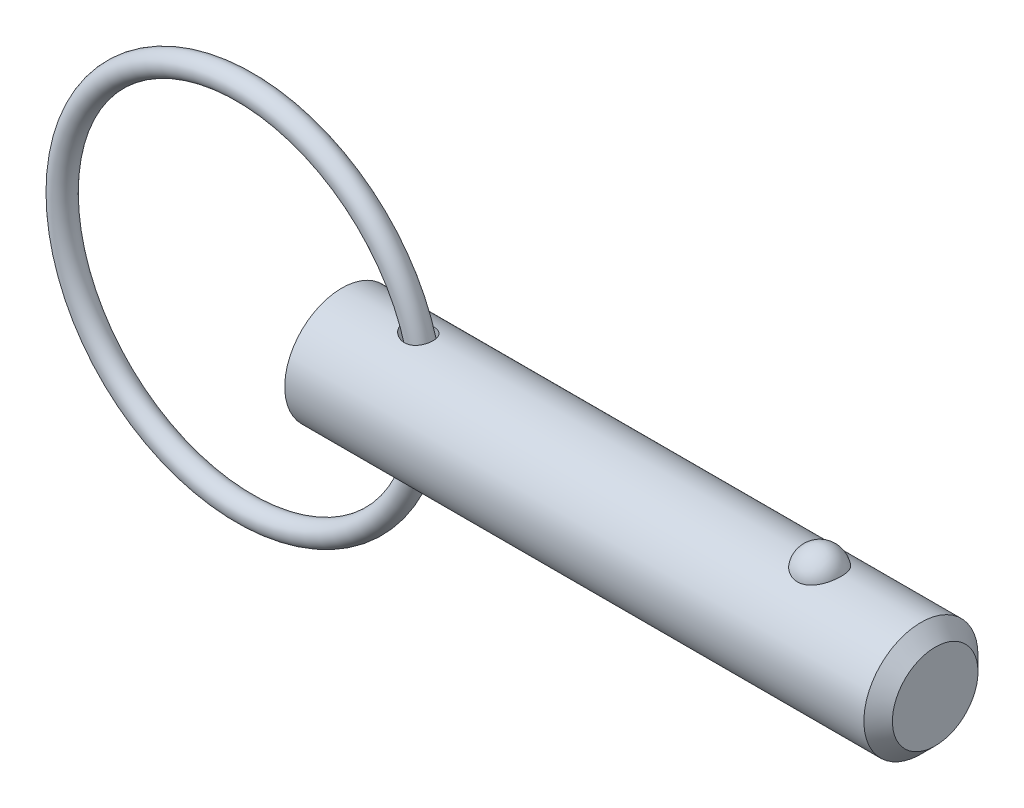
ISO-10303-21;
HEADER;
FILE_DESCRIPTION(('STEP AP214'),'2;1');
FILE_NAME('part.step','',(''),(''),'','','');
FILE_SCHEMA(('AUTOMOTIVE_DESIGN { 1 0 10303 214 1 1 1 1 }'));
ENDSEC;
DATA;
#1=APPLICATION_CONTEXT('core data for automotive mechanical design processes');
#2=APPLICATION_PROTOCOL_DEFINITION('international standard','automotive_design',2000,#1);
#3=PRODUCT_CONTEXT('',#1,'mechanical');
#4=PRODUCT('Part','Part','',(#3));
#5=PRODUCT_RELATED_PRODUCT_CATEGORY('part','',(#4));
#6=PRODUCT_DEFINITION_FORMATION('','',#4);
#7=PRODUCT_DEFINITION_CONTEXT('part definition',#1,'design');
#8=PRODUCT_DEFINITION('design','',#6,#7);
#9=PRODUCT_DEFINITION_SHAPE('','',#8);
#10=(LENGTH_UNIT() NAMED_UNIT(*) SI_UNIT(.MILLI.,.METRE.));
#11=(NAMED_UNIT(*) PLANE_ANGLE_UNIT() SI_UNIT($,.RADIAN.));
#12=(NAMED_UNIT(*) SI_UNIT($,.STERADIAN.) SOLID_ANGLE_UNIT());
#13=UNCERTAINTY_MEASURE_WITH_UNIT(LENGTH_MEASURE(1.E-05),#10,'distance_accuracy_value','');
#14=(GEOMETRIC_REPRESENTATION_CONTEXT(3) GLOBAL_UNCERTAINTY_ASSIGNED_CONTEXT((#13)) GLOBAL_UNIT_ASSIGNED_CONTEXT((#10,
#11,#12)) REPRESENTATION_CONTEXT('',''));
#15=CARTESIAN_POINT('',(0.,0.,0.));
#16=DIRECTION('',(0.,0.,1.));
#17=DIRECTION('',(1.,0.,0.));
#18=AXIS2_PLACEMENT_3D('',#15,#16,#17);
#19=CARTESIAN_POINT('',(-6.75433730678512,0.,0.));
#20=DIRECTION('',(0.,0.,1.));
#21=DIRECTION('',(1.,0.,0.));
#22=AXIS2_PLACEMENT_3D('',#19,#20,#21);
#23=TOROIDAL_SURFACE('',#22,12.7,0.794);
#24=CARTESIAN_POINT('',(6.73966269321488,0.,0.));
#25=VERTEX_POINT('',#24);
#26=VERTEX_LOOP('',#25);
#27=FACE_BOUND('',#26,.T.);
#28=ADVANCED_FACE('P0_F12',(#27),#23,.T.);
#29=CLOSED_SHELL('',(#28));
#30=MANIFOLD_SOLID_BREP('P0_B1',#29);
#31=CARTESIAN_POINT('',(0.,0.,0.));
#32=DIRECTION('',(1.,0.,0.));
#33=DIRECTION('',(0.,0.,-1.));
#34=AXIS2_PLACEMENT_3D('',#31,#32,#33);
#35=CYLINDRICAL_SURFACE('',#34,3.97);
#36=CARTESIAN_POINT('',(4.5061340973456,3.92152479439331,-0.618499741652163));
#37=CARTESIAN_POINT('',(4.54853517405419,3.91408351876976,-0.66567962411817));
#38=CARTESIAN_POINT('',(4.59520918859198,3.90637054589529,-0.709047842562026));
#39=CARTESIAN_POINT('',(4.69529850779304,3.89134328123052,-0.787367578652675));
#40=CARTESIAN_POINT('',(4.74872860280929,3.88402991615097,-0.822300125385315));
#41=CARTESIAN_POINT('',(4.86059505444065,3.87069188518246,-0.882953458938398));
#42=CARTESIAN_POINT('',(4.91902090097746,3.86466460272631,-0.908693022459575));
#43=CARTESIAN_POINT('',(5.03942053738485,3.85463812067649,-0.950329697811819));
#44=CARTESIAN_POINT('',(5.10139227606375,3.85063776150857,-0.966232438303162));
#45=CARTESIAN_POINT('',(5.22799334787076,3.84521819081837,-0.987584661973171));
#46=CARTESIAN_POINT('',(5.29264515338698,3.84382942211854,-0.992910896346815));
#47=CARTESIAN_POINT('',(5.42187784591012,3.84405510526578,-0.992040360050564));
#48=CARTESIAN_POINT('',(5.48645875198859,3.84566813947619,-0.985849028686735));
#49=CARTESIAN_POINT('',(5.60832575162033,3.85155853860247,-0.962561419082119));
#50=CARTESIAN_POINT('',(5.66579014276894,3.85562063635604,-0.946343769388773));
#51=CARTESIAN_POINT('',(5.7767533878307,3.86576598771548,-0.90400447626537));
#52=CARTESIAN_POINT('',(5.8302537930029,3.87184844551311,-0.877886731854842));
#53=CARTESIAN_POINT('',(5.92811265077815,3.88482601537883,-0.818464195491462));
#54=CARTESIAN_POINT('',(5.97284196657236,3.89164057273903,-0.785750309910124));
#55=CARTESIAN_POINT('',(6.05599619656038,3.90559314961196,-0.713164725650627));
#56=CARTESIAN_POINT('',(6.09442162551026,3.91273114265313,-0.673293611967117));
#57=CARTESIAN_POINT('',(6.16349552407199,3.92643411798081,-0.588089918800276));
#58=CARTESIAN_POINT('',(6.19423746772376,3.93300527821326,-0.542833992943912));
#59=CARTESIAN_POINT('',(6.24784048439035,3.94496273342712,-0.447731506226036));
#60=CARTESIAN_POINT('',(6.27070130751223,3.95034899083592,-0.397884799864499));
#61=CARTESIAN_POINT('',(6.30819009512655,3.95940331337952,-0.294515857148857));
#62=CARTESIAN_POINT('',(6.32274046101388,3.96305513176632,-0.240964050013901));
#63=CARTESIAN_POINT('',(6.34295490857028,3.96817541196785,-0.13210707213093));
#64=CARTESIAN_POINT('',(6.34861870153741,3.96964380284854,-0.0768018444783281));
#65=CARTESIAN_POINT('',(6.35094049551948,3.97024250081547,0.0343098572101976));
#66=CARTESIAN_POINT('',(6.34754972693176,3.96936014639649,0.090117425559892));
#67=CARTESIAN_POINT('',(6.33173352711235,3.9653248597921,0.200354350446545));
#68=CARTESIAN_POINT('',(6.31930791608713,3.96217188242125,0.25478367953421));
#69=CARTESIAN_POINT('',(6.28569545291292,3.95393415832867,0.360736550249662));
#70=CARTESIAN_POINT('',(6.26450524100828,3.94884867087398,0.41225896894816));
#71=CARTESIAN_POINT('',(6.21385621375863,3.93730247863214,0.510898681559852));
#72=CARTESIAN_POINT('',(6.1843975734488,3.93084180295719,0.558016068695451));
#73=CARTESIAN_POINT('',(6.11807283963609,3.91729312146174,0.64630042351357));
#74=CARTESIAN_POINT('',(6.08123803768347,3.91020783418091,0.68749130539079));
#75=CARTESIAN_POINT('',(6.00105036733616,3.89618447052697,0.762970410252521));
#76=CARTESIAN_POINT('',(5.95769831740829,3.88924637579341,0.797259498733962));
#77=CARTESIAN_POINT('',(5.86613530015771,3.87636375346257,0.857702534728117));
#78=CARTESIAN_POINT('',(5.81797537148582,3.87041026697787,0.883931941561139));
#79=CARTESIAN_POINT('',(5.71784316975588,3.86006042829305,0.928089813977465));
#80=CARTESIAN_POINT('',(5.66587104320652,3.85566401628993,0.946018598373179));
#81=CARTESIAN_POINT('',(5.55935910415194,3.84884784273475,0.973381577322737));
#82=CARTESIAN_POINT('',(5.5048082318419,3.84643760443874,0.982774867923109));
#83=CARTESIAN_POINT('',(5.39486598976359,3.84381055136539,0.992999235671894));
#84=CARTESIAN_POINT('',(5.33947443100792,3.84359423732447,0.993828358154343));
#85=CARTESIAN_POINT('',(5.2264823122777,3.84533176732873,0.987084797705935));
#86=CARTESIAN_POINT('',(5.16890896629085,3.84739412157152,0.979092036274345));
#87=CARTESIAN_POINT('',(5.05572652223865,3.85355237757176,0.954563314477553));
#88=CARTESIAN_POINT('',(5.0001182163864,3.85764908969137,0.938023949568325));
#89=CARTESIAN_POINT('',(4.88760177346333,3.86780726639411,0.8952592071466));
#90=CARTESIAN_POINT('',(4.83096658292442,3.87400321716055,0.868345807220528));
#91=CARTESIAN_POINT('',(4.72283286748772,3.88749324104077,0.805802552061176));
#92=CARTESIAN_POINT('',(4.67133743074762,3.89478796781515,0.770167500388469));
#93=CARTESIAN_POINT('',(4.57320957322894,3.90992457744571,0.689306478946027));
#94=CARTESIAN_POINT('',(4.52683185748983,3.91777672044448,0.643771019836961));
#95=CARTESIAN_POINT('',(4.44324307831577,3.93275681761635,0.544809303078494));
#96=CARTESIAN_POINT('',(4.40602610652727,3.939885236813,0.491388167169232));
#97=CARTESIAN_POINT('',(4.34571986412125,3.95183347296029,0.382912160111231));
#98=CARTESIAN_POINT('',(4.32168268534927,3.95680025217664,0.32840447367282));
#99=CARTESIAN_POINT('',(4.28478280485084,3.96454157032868,0.215602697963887));
#100=CARTESIAN_POINT('',(4.27190231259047,3.96731959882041,0.157314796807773));
#101=CARTESIAN_POINT('',(4.25937356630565,3.97002560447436,0.0481762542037));
#102=CARTESIAN_POINT('',(4.25802727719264,3.97031923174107,-0.0024752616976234));
#103=CARTESIAN_POINT('',(4.26422295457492,3.96897737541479,-0.103210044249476));
#104=CARTESIAN_POINT('',(4.27176468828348,3.96734194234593,-0.15329332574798));
#105=CARTESIAN_POINT('',(4.29457390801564,3.96248430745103,-0.24853074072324));
#106=CARTESIAN_POINT('',(4.30937736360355,3.95935769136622,-0.293803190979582));
#107=CARTESIAN_POINT('',(4.34569993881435,3.95187968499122,-0.381417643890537));
#108=CARTESIAN_POINT('',(4.36721517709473,3.94752900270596,-0.423761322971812));
#109=CARTESIAN_POINT('',(4.4082169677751,3.93952317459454,-0.491758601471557));
#110=CARTESIAN_POINT('',(4.4261351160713,3.93609353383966,-0.518404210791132));
#111=CARTESIAN_POINT('',(4.464383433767,3.92897396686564,-0.569857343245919));
#112=CARTESIAN_POINT('',(4.48471350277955,3.92528405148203,-0.594664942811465));
#113=CARTESIAN_POINT('',(4.5061340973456,3.92152479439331,-0.618499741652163));
#114=B_SPLINE_CURVE_WITH_KNOTS('',3,(#36,#37,#38,#39,#40,#41,#42,#43,#44,#45,#46,#47,#48,#49,
#50,#51,#52,#53,#54,#55,#56,#57,#58,#59,#60,#61,#62,#63,#64,#65,#66,#67,#68,#69,#70,#71,#72,#73,
#74,#75,#76,#77,#78,#79,#80,#81,#82,#83,#84,#85,#86,#87,#88,#89,#90,#91,#92,#93,#94,#95,#96,#97,
#98,#99,#100,#101,#102,#103,#104,#105,#106,#107,#108,#109,#110,#111,#112,#113),.UNSPECIFIED.,
.T.,.F.,(4,2,2,2,2,2,2,2,2,2,2,2,2,2,2,2,2,2,2,2,2,2,2,2,2,2,2,2,2,2,2,2,2,2,2,2,2,2,4),(0.,
0.191481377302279,0.383389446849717,0.574903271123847,0.766307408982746,0.959929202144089,
1.15345957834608,1.33205157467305,1.51057330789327,1.67726576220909,1.84394459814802,
2.00848443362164,2.17302948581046,2.33908685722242,2.50514962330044,2.6721086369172,
2.83907097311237,3.00609737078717,3.17312023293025,3.33944900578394,3.5057569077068,
3.67045663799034,3.83515004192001,4.00062859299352,4.16614491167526,4.33989638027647,
4.51371711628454,4.70191549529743,4.8902262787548,5.0855971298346,5.28084164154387,
5.45908728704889,5.63704817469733,5.78825771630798,5.93946329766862,6.08206496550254,
6.22458432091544,6.32132279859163,6.41805725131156),.UNSPECIFIED.);
#115=CARTESIAN_POINT('',(4.5061340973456,3.92152479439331,-0.618499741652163));
#116=VERTEX_POINT('',#115);
#117=EDGE_CURVE('P1_E40',#116,#116,#114,.T.);
#118=ORIENTED_EDGE('',*,*,#117,.T.);
#119=EDGE_LOOP('',(#118));
#120=FACE_BOUND('',#119,.T.);
#121=CARTESIAN_POINT('',(40.2875,0.,0.));
#122=DIRECTION('',(1.,0.,0.));
#123=DIRECTION('',(0.,0.,-1.));
#124=AXIS2_PLACEMENT_3D('',#121,#122,#123);
#125=CIRCLE('',#124,3.97);
#126=CARTESIAN_POINT('',(40.2875,0.,-3.97));
#127=VERTEX_POINT('',#126);
#128=EDGE_CURVE('P1_E25',#127,#127,#125,.T.);
#129=ORIENTED_EDGE('',*,*,#128,.F.);
#130=EDGE_LOOP('',(#129));
#131=FACE_BOUND('',#130,.T.);
#132=CARTESIAN_POINT('',(0.,0.,0.));
#133=DIRECTION('',(1.,0.,0.));
#134=DIRECTION('',(0.,0.,-1.));
#135=AXIS2_PLACEMENT_3D('',#132,#133,#134);
#136=CIRCLE('',#135,3.97);
#137=CARTESIAN_POINT('',(0.,0.,-3.97));
#138=VERTEX_POINT('',#137);
#139=EDGE_CURVE('P1_E9',#138,#138,#136,.T.);
#140=ORIENTED_EDGE('',*,*,#139,.T.);
#141=EDGE_LOOP('',(#140));
#142=FACE_BOUND('',#141,.T.);
#143=CARTESIAN_POINT('',(33.2451922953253,3.65715365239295,1.54470941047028));
#144=CARTESIAN_POINT('',(33.1652448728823,3.65716001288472,1.54470290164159));
#145=CARTESIAN_POINT('',(33.0851650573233,3.65987074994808,1.53832549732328));
#146=CARTESIAN_POINT('',(32.9272374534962,3.6704221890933,1.51297018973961));
#147=CARTESIAN_POINT('',(32.8493961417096,3.67827646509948,1.49395894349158));
#148=CARTESIAN_POINT('',(32.6984614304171,3.69818848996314,1.44395950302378));
#149=CARTESIAN_POINT('',(32.6253560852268,3.71023513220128,1.41300293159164));
#150=CARTESIAN_POINT('',(32.4855630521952,3.73721833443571,1.34000212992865));
#151=CARTESIAN_POINT('',(32.4188725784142,3.75215363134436,1.2979627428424));
#152=CARTESIAN_POINT('',(32.29148864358,3.78384968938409,1.20248834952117));
#153=CARTESIAN_POINT('',(32.2310299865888,3.80065129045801,1.14875388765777));
#154=CARTESIAN_POINT('',(32.1196942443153,3.83398532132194,1.03205417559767));
#155=CARTESIAN_POINT('',(32.0688200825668,3.85051766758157,0.969086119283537));
#156=CARTESIAN_POINT('',(31.9756321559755,3.88238608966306,0.832526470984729));
#157=CARTESIAN_POINT('',(31.9337961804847,3.89763698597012,0.758588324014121));
#158=CARTESIAN_POINT('',(31.8625108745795,3.92451063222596,0.60435211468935));
#159=CARTESIAN_POINT('',(31.8330623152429,3.93613315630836,0.524053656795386));
#160=CARTESIAN_POINT('',(31.7868927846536,3.95467606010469,0.35840348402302));
#161=CARTESIAN_POINT('',(31.7703127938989,3.96154426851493,0.273006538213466));
#162=CARTESIAN_POINT('',(31.750756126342,3.96967008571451,0.100408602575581));
#163=CARTESIAN_POINT('',(31.7477789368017,3.97092790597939,0.0132076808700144));
#164=CARTESIAN_POINT('',(31.7554587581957,3.96771794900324,-0.159844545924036));
#165=CARTESIAN_POINT('',(31.7660164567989,3.96329187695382,-0.245701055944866));
#166=CARTESIAN_POINT('',(31.8003800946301,3.94923163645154,-0.414277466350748));
#167=CARTESIAN_POINT('',(31.8241862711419,3.9395973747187,-0.496997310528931));
#168=CARTESIAN_POINT('',(31.8846114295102,3.91607752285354,-0.657113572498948));
#169=CARTESIAN_POINT('',(31.9212495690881,3.90218558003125,-0.734501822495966));
#170=CARTESIAN_POINT('',(32.0065935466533,3.87158287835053,-0.881704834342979));
#171=CARTESIAN_POINT('',(32.0553004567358,3.8548718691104,-0.951518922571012));
#172=CARTESIAN_POINT('',(32.1641161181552,3.82028735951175,-1.08208159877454));
#173=CARTESIAN_POINT('',(32.2242955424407,3.80240713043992,-1.14276958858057));
#174=CARTESIAN_POINT('',(32.354493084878,3.76758161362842,-1.2528243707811));
#175=CARTESIAN_POINT('',(32.4245105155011,3.75063626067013,-1.30219195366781));
#176=CARTESIAN_POINT('',(32.57118160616,3.71998948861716,-1.38729709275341));
#177=CARTESIAN_POINT('',(32.6476813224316,3.70623183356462,-1.42327904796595));
#178=CARTESIAN_POINT('',(32.8062981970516,3.68323188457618,-1.48178996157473));
#179=CARTESIAN_POINT('',(32.8884132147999,3.67398788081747,-1.5043240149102));
#180=CARTESIAN_POINT('',(33.0514810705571,3.6615216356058,-1.53440939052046));
#181=CARTESIAN_POINT('',(33.1322840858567,3.65801951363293,-1.54265826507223));
#182=CARTESIAN_POINT('',(33.2942085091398,3.65657341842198,-1.5460842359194));
#183=CARTESIAN_POINT('',(33.3753298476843,3.65862829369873,-1.54126404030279));
#184=CARTESIAN_POINT('',(33.5328122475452,3.66788969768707,-1.51908474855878));
#185=CARTESIAN_POINT('',(33.6092422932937,3.67492621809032,-1.50213925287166));
#186=CARTESIAN_POINT('',(33.7580412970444,3.69318404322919,-1.45666982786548));
#187=CARTESIAN_POINT('',(33.8304099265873,3.70440568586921,-1.42814496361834));
#188=CARTESIAN_POINT('',(33.9708029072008,3.73012749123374,-1.35956319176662));
#189=CARTESIAN_POINT('',(34.0387000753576,3.74469307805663,-1.31927107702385));
#190=CARTESIAN_POINT('',(34.1668649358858,3.77545272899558,-1.22847440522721));
#191=CARTESIAN_POINT('',(34.2271308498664,3.79164717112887,-1.17796747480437));
#192=CARTESIAN_POINT('',(34.3416346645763,3.82490325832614,-1.06519260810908));
#193=CARTESIAN_POINT('',(34.3954137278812,3.84196735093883,-1.00245914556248));
#194=CARTESIAN_POINT('',(34.4920988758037,3.87439863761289,-0.868715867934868));
#195=CARTESIAN_POINT('',(34.5350030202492,3.88976552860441,-0.797704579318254));
#196=CARTESIAN_POINT('',(34.610266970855,3.91771381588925,-0.646896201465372));
#197=CARTESIAN_POINT('',(34.6422532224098,3.93019255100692,-0.566893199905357));
#198=CARTESIAN_POINT('',(34.6931101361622,3.95043886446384,-0.40225513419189));
#199=CARTESIAN_POINT('',(34.7119807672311,3.95820643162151,-0.317620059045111));
#200=CARTESIAN_POINT('',(34.7362162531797,3.96823733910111,-0.14615699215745));
#201=CARTESIAN_POINT('',(34.7415874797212,3.970503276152,-0.0593300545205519));
#202=CARTESIAN_POINT('',(34.738730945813,3.96930811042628,0.114057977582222));
#203=CARTESIAN_POINT('',(34.7305035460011,3.9658471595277,0.200619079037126));
#204=CARTESIAN_POINT('',(34.7007063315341,3.95358562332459,0.370506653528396));
#205=CARTESIAN_POINT('',(34.6792129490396,3.94481563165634,0.453848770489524));
#206=CARTESIAN_POINT('',(34.6233839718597,3.92284586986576,0.615497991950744));
#207=CARTESIAN_POINT('',(34.5890474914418,3.90964579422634,0.693804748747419));
#208=CARTESIAN_POINT('',(34.5079702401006,3.88006987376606,0.843703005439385));
#209=CARTESIAN_POINT('',(34.4611536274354,3.86367478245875,0.915249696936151));
#210=CARTESIAN_POINT('',(34.3561897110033,3.82949741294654,1.04910810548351));
#211=CARTESIAN_POINT('',(34.2980428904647,3.81171519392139,1.11142021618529));
#212=CARTESIAN_POINT('',(34.1717433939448,3.77673366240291,1.22503948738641));
#213=CARTESIAN_POINT('',(34.1035970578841,3.75953398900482,1.27635357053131));
#214=CARTESIAN_POINT('',(33.9589009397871,3.72770506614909,1.36653336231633));
#215=CARTESIAN_POINT('',(33.882348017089,3.71307678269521,1.40539439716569));
#216=CARTESIAN_POINT('',(33.7257594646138,3.68864287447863,1.46830480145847));
#217=CARTESIAN_POINT('',(33.6459307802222,3.67869017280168,1.49281289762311));
#218=CARTESIAN_POINT('',(33.4829877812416,3.66414535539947,1.52817474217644));
#219=CARTESIAN_POINT('',(33.3998840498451,3.65953723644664,1.53906926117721));
#220=CARTESIAN_POINT('',(33.2927760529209,3.6573894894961,1.54414878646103));
#221=CARTESIAN_POINT('',(33.2689900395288,3.65715175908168,1.54471134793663));
#222=CARTESIAN_POINT('',(33.2451922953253,3.65715365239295,1.54470941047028));
#223=B_SPLINE_CURVE_WITH_KNOTS('',3,(#143,#144,#145,#146,#147,#148,#149,#150,#151,#152,#153,
#154,#155,#156,#157,#158,#159,#160,#161,#162,#163,#164,#165,#166,#167,#168,#169,#170,#171,#172,
#173,#174,#175,#176,#177,#178,#179,#180,#181,#182,#183,#184,#185,#186,#187,#188,#189,#190,#191,
#192,#193,#194,#195,#196,#197,#198,#199,#200,#201,#202,#203,#204,#205,#206,#207,#208,#209,#210,
#211,#212,#213,#214,#215,#216,#217,#218,#219,#220,#221,#222),.UNSPECIFIED.,.T.,.F.,(4,2,2,2,2,2,
2,2,2,2,2,2,2,2,2,2,2,2,2,2,2,2,2,2,2,2,2,2,2,2,2,2,2,2,2,2,2,2,2,4),(0.,0.239777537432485,
0.480190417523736,0.719971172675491,0.959647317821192,1.20639040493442,1.4532086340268,
1.7109367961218,1.96868099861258,2.22921052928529,2.48973023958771,2.74834928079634,
3.00697295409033,3.26598440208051,3.52501886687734,3.78570385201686,4.04637062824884,
4.30201257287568,4.55755760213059,4.80022994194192,5.04285200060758,5.27757006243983,
5.51230707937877,5.75210128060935,5.99195126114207,6.24392810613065,6.49594987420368,
6.75588818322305,7.01582710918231,7.27564332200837,7.53545264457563,7.79377886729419,
8.0521229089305,8.31207418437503,8.57201437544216,8.83179046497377,9.09166393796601,
9.34270057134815,9.59298357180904,9.66435753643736),.UNSPECIFIED.);
#224=CARTESIAN_POINT('',(33.2451922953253,3.65715365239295,1.54470941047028));
#225=VERTEX_POINT('',#224);
#226=EDGE_CURVE('P1_E34',#225,#225,#223,.T.);
#227=ORIENTED_EDGE('',*,*,#226,.T.);
#228=EDGE_LOOP('',(#227));
#229=FACE_BOUND('',#228,.T.);
#230=CARTESIAN_POINT('',(4.5061340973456,-3.92152479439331,-0.618499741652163));
#231=CARTESIAN_POINT('',(4.47063221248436,-3.92775524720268,-0.578995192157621));
#232=CARTESIAN_POINT('',(4.43810149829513,-3.93379908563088,-0.536794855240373));
#233=CARTESIAN_POINT('',(4.38017497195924,-3.94493883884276,-0.447628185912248));
#234=CARTESIAN_POINT('',(4.35477467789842,-3.95003534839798,-0.400664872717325));
#235=CARTESIAN_POINT('',(4.31221789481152,-3.95875465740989,-0.302642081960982));
#236=CARTESIAN_POINT('',(4.29511088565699,-3.96236859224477,-0.251560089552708));
#237=CARTESIAN_POINT('',(4.27046538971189,-3.96762012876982,-0.147036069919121));
#238=CARTESIAN_POINT('',(4.26292104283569,-3.96925894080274,-0.0935955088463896));
#239=CARTESIAN_POINT('',(4.25814817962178,-3.97029345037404,0.00916757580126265));
#240=CARTESIAN_POINT('',(4.26009234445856,-3.96986905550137,0.058451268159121));
#241=CARTESIAN_POINT('',(4.2722946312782,-3.96723648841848,0.155921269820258));
#242=CARTESIAN_POINT('',(4.28255257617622,-3.96502835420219,0.204107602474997));
#243=CARTESIAN_POINT('',(4.3104038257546,-3.95915538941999,0.296804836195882));
#244=CARTESIAN_POINT('',(4.32779766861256,-3.95553028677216,0.341378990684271));
#245=CARTESIAN_POINT('',(4.36906896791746,-3.94717481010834,0.427290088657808));
#246=CARTESIAN_POINT('',(4.3929482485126,-3.94244412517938,0.468626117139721));
#247=CARTESIAN_POINT('',(4.44891306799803,-3.93178155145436,0.551268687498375));
#248=CARTESIAN_POINT('',(4.48157347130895,-3.92577737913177,0.592175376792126));
#249=CARTESIAN_POINT('',(4.55251112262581,-3.91346489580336,0.668729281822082));
#250=CARTESIAN_POINT('',(4.59079150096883,-3.90715641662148,0.704373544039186));
#251=CARTESIAN_POINT('',(4.67775521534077,-3.89387548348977,0.774654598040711));
#252=CARTESIAN_POINT('',(4.72714377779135,-3.88693620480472,0.808427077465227));
#253=CARTESIAN_POINT('',(4.83064277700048,-3.8740635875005,0.868022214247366));
#254=CARTESIAN_POINT('',(4.88475591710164,-3.86813083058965,0.893840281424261));
#255=CARTESIAN_POINT('',(5.00110106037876,-3.85749476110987,0.938729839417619));
#256=CARTESIAN_POINT('',(5.06363405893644,-3.85293457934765,0.957062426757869));
#257=CARTESIAN_POINT('',(5.19104406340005,-3.84642688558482,0.98289453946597));
#258=CARTESIAN_POINT('',(5.25592057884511,-3.84447883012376,0.990396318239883));
#259=CARTESIAN_POINT('',(5.38389367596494,-3.84360582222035,0.993779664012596));
#260=CARTESIAN_POINT('',(5.44697893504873,-3.84458391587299,0.990033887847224));
#261=CARTESIAN_POINT('',(5.57135239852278,-3.84935403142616,0.971322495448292));
#262=CARTESIAN_POINT('',(5.63264168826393,-3.85314431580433,0.956363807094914));
#263=CARTESIAN_POINT('',(5.74616757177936,-3.86267246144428,0.917075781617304));
#264=CARTESIAN_POINT('',(5.79873169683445,-3.86821908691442,0.893643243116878));
#265=CARTESIAN_POINT('',(5.89880370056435,-3.88065529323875,0.837987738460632));
#266=CARTESIAN_POINT('',(5.94631268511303,-3.88754457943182,0.805766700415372));
#267=CARTESIAN_POINT('',(6.03285109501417,-3.90151699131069,0.735052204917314));
#268=CARTESIAN_POINT('',(6.07216200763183,-3.90857818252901,0.696897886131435));
#269=CARTESIAN_POINT('',(6.14379115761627,-3.92238187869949,0.614461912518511));
#270=CARTESIAN_POINT('',(6.17610956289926,-3.92912439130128,0.570180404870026));
#271=CARTESIAN_POINT('',(6.23298117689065,-3.94155789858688,0.476700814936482));
#272=CARTESIAN_POINT('',(6.25752764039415,-3.94724797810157,0.427498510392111));
#273=CARTESIAN_POINT('',(6.29825018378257,-3.95695712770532,0.325589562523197));
#274=CARTESIAN_POINT('',(6.31442591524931,-3.96097612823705,0.272882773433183));
#275=CARTESIAN_POINT('',(6.33815165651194,-3.96694319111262,0.164947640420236));
#276=CARTESIAN_POINT('',(6.34562253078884,-3.96887224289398,0.10970083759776));
#277=CARTESIAN_POINT('',(6.35150690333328,-3.97038782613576,-0.00130546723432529));
#278=CARTESIAN_POINT('',(6.34992017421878,-3.96997429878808,-0.057064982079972));
#279=CARTESIAN_POINT('',(6.33770614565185,-3.96684417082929,-0.16768512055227));
#280=CARTESIAN_POINT('',(6.32705245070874,-3.96412084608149,-0.222542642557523));
#281=CARTESIAN_POINT('',(6.29690849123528,-3.95665587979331,-0.329631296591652));
#282=CARTESIAN_POINT('',(6.27741810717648,-3.95191421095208,-0.381862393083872));
#283=CARTESIAN_POINT('',(6.23007557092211,-3.94093577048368,-0.482151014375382));
#284=CARTESIAN_POINT('',(6.20223216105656,-3.93470056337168,-0.530212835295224));
#285=CARTESIAN_POINT('',(6.13885089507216,-3.92142345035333,-0.620836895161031));
#286=CARTESIAN_POINT('',(6.10331353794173,-3.9143815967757,-0.663399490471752));
#287=CARTESIAN_POINT('',(6.02573506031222,-3.90033441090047,-0.741525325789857));
#288=CARTESIAN_POINT('',(5.9837408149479,-3.89332916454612,-0.777135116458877));
#289=CARTESIAN_POINT('',(5.89422937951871,-3.88009391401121,-0.840731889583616));
#290=CARTESIAN_POINT('',(5.84671289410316,-3.87386381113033,-0.868719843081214));
#291=CARTESIAN_POINT('',(5.74792005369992,-3.86290904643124,-0.916201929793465));
#292=CARTESIAN_POINT('',(5.69667597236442,-3.85817300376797,-0.935760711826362));
#293=CARTESIAN_POINT('',(5.59158164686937,-3.85061943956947,-0.966374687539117));
#294=CARTESIAN_POINT('',(5.53773121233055,-3.84780205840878,-0.97742925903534));
#295=CARTESIAN_POINT('',(5.42780663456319,-3.84428235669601,-0.991183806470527));
#296=CARTESIAN_POINT('',(5.37170954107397,-3.84362414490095,-0.993709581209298));
#297=CARTESIAN_POINT('',(5.25980914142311,-3.84452352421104,-0.990222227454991));
#298=CARTESIAN_POINT('',(5.20400591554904,-3.84608169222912,-0.984206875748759));
#299=CARTESIAN_POINT('',(5.09021941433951,-3.85134557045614,-0.963410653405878));
#300=CARTESIAN_POINT('',(5.03234703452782,-3.85519050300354,-0.948059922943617));
#301=CARTESIAN_POINT('',(4.91972924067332,-3.86464451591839,-0.908751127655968));
#302=CARTESIAN_POINT('',(4.86498619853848,-3.87025491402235,-0.884786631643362));
#303=CARTESIAN_POINT('',(4.75497621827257,-3.88320265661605,-0.826208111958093));
#304=CARTESIAN_POINT('',(4.70013922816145,-3.89065244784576,-0.790807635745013));
#305=CARTESIAN_POINT('',(4.59743373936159,-3.90600301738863,-0.711112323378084));
#306=CARTESIAN_POINT('',(4.54956105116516,-3.91390352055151,-0.666822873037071));
#307=CARTESIAN_POINT('',(4.5061340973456,-3.92152479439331,-0.618499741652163));
#308=B_SPLINE_CURVE_WITH_KNOTS('',3,(#230,#231,#232,#233,#234,#235,#236,#237,#238,#239,#240,
#241,#242,#243,#244,#245,#246,#247,#248,#249,#250,#251,#252,#253,#254,#255,#256,#257,#258,#259,
#260,#261,#262,#263,#264,#265,#266,#267,#268,#269,#270,#271,#272,#273,#274,#275,#276,#277,#278,
#279,#280,#281,#282,#283,#284,#285,#286,#287,#288,#289,#290,#291,#292,#293,#294,#295,#296,#297,
#298,#299,#300,#301,#302,#303,#304,#305,#306,#307),.UNSPECIFIED.,.T.,.F.,(4,2,2,2,2,2,2,2,2,2,2,
2,2,2,2,2,2,2,2,2,2,2,2,2,2,2,2,2,2,2,2,2,2,2,2,2,2,2,4),(0.,0.160252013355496,
0.320403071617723,0.481498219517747,0.642494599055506,0.78971746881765,0.936937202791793,
1.08029540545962,1.22369397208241,1.38114509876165,1.53868426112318,1.7186296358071,
1.89867865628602,2.09368931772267,2.28865940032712,2.47724174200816,2.66570766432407,
2.83827720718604,3.01080892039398,3.17573461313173,3.34065634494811,3.50572082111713,
3.67079216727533,3.83735274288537,4.00391749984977,4.17096882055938,4.33802240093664,
4.50490174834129,4.6717702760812,4.83748008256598,5.0031687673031,5.16756302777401,
5.3319693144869,5.49971393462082,5.66750222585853,5.84673431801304,6.02610050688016,
6.22224398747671,6.41826898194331),.UNSPECIFIED.);
#309=CARTESIAN_POINT('',(4.5061340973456,-3.92152479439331,-0.618499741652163));
#310=VERTEX_POINT('',#309);
#311=EDGE_CURVE('P1_E17',#310,#310,#308,.T.);
#312=ORIENTED_EDGE('',*,*,#311,.T.);
#313=EDGE_LOOP('',(#312));
#314=FACE_BOUND('',#313,.T.);
#315=ADVANCED_FACE('P1_F13',(#120,#131,#142,#229,#314),#35,.T.);
#316=CARTESIAN_POINT('',(0.,0.,0.));
#317=DIRECTION('',(-1.,0.,0.));
#318=DIRECTION('',(0.,0.,1.));
#319=AXIS2_PLACEMENT_3D('',#316,#317,#318);
#320=PLANE('',#319);
#321=ORIENTED_EDGE('',*,*,#139,.F.);
#322=EDGE_LOOP('',(#321));
#323=FACE_BOUND('',#322,.T.);
#324=ADVANCED_FACE('P1_F15',(#323),#320,.T.);
#325=CARTESIAN_POINT('',(41.28,0.,0.));
#326=DIRECTION('',(-1.,0.,0.));
#327=DIRECTION('',(0.,0.,1.));
#328=AXIS2_PLACEMENT_3D('',#325,#326,#327);
#329=CONICAL_SURFACE('',#328,2.97750000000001,0.785398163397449);
#330=ORIENTED_EDGE('',*,*,#128,.T.);
#331=EDGE_LOOP('',(#330));
#332=FACE_BOUND('',#331,.T.);
#333=CARTESIAN_POINT('',(41.28,0.,0.));
#334=DIRECTION('',(1.,0.,0.));
#335=DIRECTION('',(0.,0.,-1.));
#336=AXIS2_PLACEMENT_3D('',#333,#334,#335);
#337=CIRCLE('',#336,2.97750000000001);
#338=CARTESIAN_POINT('',(41.28,0.,-2.97750000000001));
#339=VERTEX_POINT('',#338);
#340=EDGE_CURVE('P1_E30',#339,#339,#337,.T.);
#341=ORIENTED_EDGE('',*,*,#340,.F.);
#342=EDGE_LOOP('',(#341));
#343=FACE_BOUND('',#342,.T.);
#344=ADVANCED_FACE('P1_F55',(#332,#343),#329,.T.);
#345=CARTESIAN_POINT('',(41.28,2.97750000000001,0.));
#346=DIRECTION('',(1.,0.,0.));
#347=DIRECTION('',(0.,0.,-1.));
#348=AXIS2_PLACEMENT_3D('',#345,#346,#347);
#349=PLANE('',#348);
#350=ORIENTED_EDGE('',*,*,#340,.T.);
#351=EDGE_LOOP('',(#350));
#352=FACE_BOUND('',#351,.T.);
#353=ADVANCED_FACE('P1_F51',(#352),#349,.T.);
#354=CARTESIAN_POINT('',(33.2451922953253,3.573,0.));
#355=DIRECTION('',(-1.,0.,0.));
#356=DIRECTION('',(0.,1.,0.));
#357=AXIS2_PLACEMENT_3D('',#354,#355,#356);
#358=SPHERICAL_SURFACE('',#357,1.54699999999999);
#359=ORIENTED_EDGE('',*,*,#226,.F.);
#360=EDGE_LOOP('',(#359));
#361=FACE_BOUND('',#360,.T.);
#362=ADVANCED_FACE('P1_F46',(#361),#358,.T.);
#363=CARTESIAN_POINT('',(-6.7543373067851,0.,0.));
#364=DIRECTION('',(0.,0.,1.));
#365=DIRECTION('',(1.,0.,0.));
#366=AXIS2_PLACEMENT_3D('',#363,#364,#365);
#367=TOROIDAL_SURFACE('',#366,12.7,0.9925);
#368=ORIENTED_EDGE('',*,*,#311,.F.);
#369=EDGE_LOOP('',(#368));
#370=FACE_BOUND('',#369,.T.);
#371=ORIENTED_EDGE('',*,*,#117,.F.);
#372=EDGE_LOOP('',(#371));
#373=FACE_BOUND('',#372,.T.);
#374=ADVANCED_FACE('P1_F50',(#370,#373),#367,.F.);
#375=CLOSED_SHELL('',(#315,#324,#344,#353,#362,#374));
#376=MANIFOLD_SOLID_BREP('P1_B1',#375);
#377=ADVANCED_BREP_SHAPE_REPRESENTATION('',(#18,#30,#376),#14);
#378=SHAPE_DEFINITION_REPRESENTATION(#9,#377);
ENDSEC;
END-ISO-10303-21;
